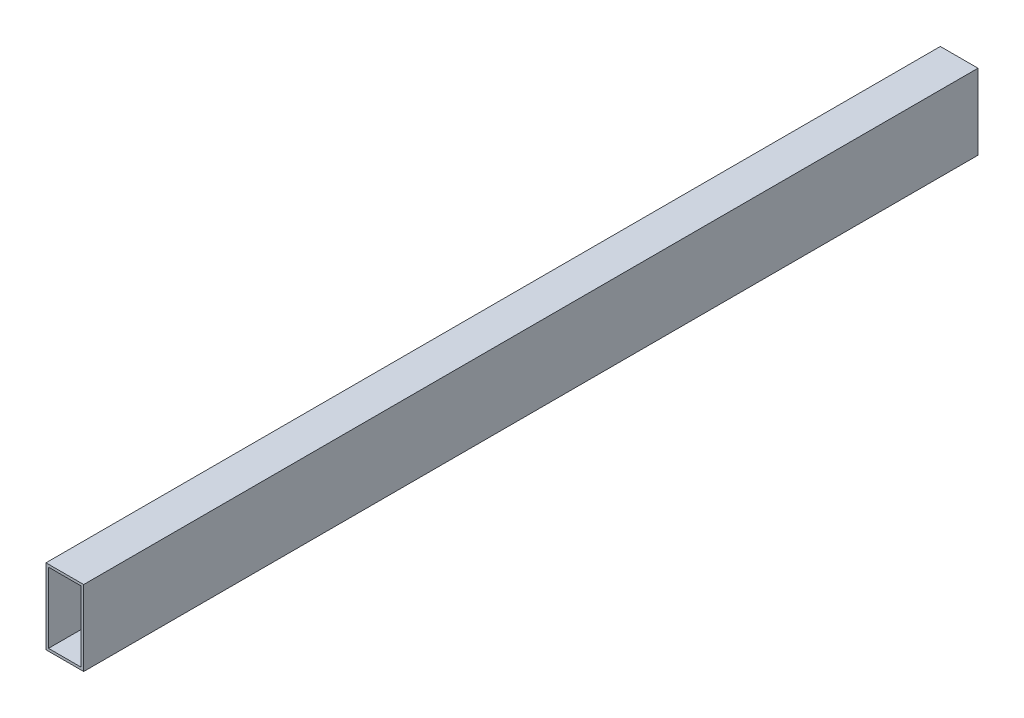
ISO-10303-21;
HEADER;
FILE_DESCRIPTION(('STEP AP214'),'2;1');
FILE_NAME('part.step','',(''),(''),'','','');
FILE_SCHEMA(('AUTOMOTIVE_DESIGN { 1 0 10303 214 1 1 1 1 }'));
ENDSEC;
DATA;
#1=APPLICATION_CONTEXT('core data for automotive mechanical design processes');
#2=APPLICATION_PROTOCOL_DEFINITION('international standard','automotive_design',2000,#1);
#3=PRODUCT_CONTEXT('',#1,'mechanical');
#4=PRODUCT('Part','Part','',(#3));
#5=PRODUCT_RELATED_PRODUCT_CATEGORY('part','',(#4));
#6=PRODUCT_DEFINITION_FORMATION('','',#4);
#7=PRODUCT_DEFINITION_CONTEXT('part definition',#1,'design');
#8=PRODUCT_DEFINITION('design','',#6,#7);
#9=PRODUCT_DEFINITION_SHAPE('','',#8);
#10=(LENGTH_UNIT() NAMED_UNIT(*) SI_UNIT(.MILLI.,.METRE.));
#11=(NAMED_UNIT(*) PLANE_ANGLE_UNIT() SI_UNIT($,.RADIAN.));
#12=(NAMED_UNIT(*) SI_UNIT($,.STERADIAN.) SOLID_ANGLE_UNIT());
#13=UNCERTAINTY_MEASURE_WITH_UNIT(LENGTH_MEASURE(1.E-05),#10,'distance_accuracy_value','');
#14=(GEOMETRIC_REPRESENTATION_CONTEXT(3) GLOBAL_UNCERTAINTY_ASSIGNED_CONTEXT((#13)) GLOBAL_UNIT_ASSIGNED_CONTEXT((#10,
#11,#12)) REPRESENTATION_CONTEXT('',''));
#15=CARTESIAN_POINT('',(0.,0.,0.));
#16=DIRECTION('',(0.,0.,1.));
#17=DIRECTION('',(1.,0.,0.));
#18=AXIS2_PLACEMENT_3D('',#15,#16,#17);
#19=CARTESIAN_POINT('',(0.,0.,1780.));
#20=DIRECTION('',(0.,0.,1.));
#21=DIRECTION('',(1.,0.,0.));
#22=AXIS2_PLACEMENT_3D('',#19,#20,#21);
#23=PLANE('',#22);
#24=DIRECTION('',(0.,-1.,0.));
#25=VECTOR('',#24,1.);
#26=CARTESIAN_POINT('',(-32.5,70.,1780.));
#27=LINE('',#26,#25);
#28=CARTESIAN_POINT('',(-32.5,70.,1780.));
#29=VERTEX_POINT('',#28);
#30=CARTESIAN_POINT('',(-32.5,-70.,1780.));
#31=VERTEX_POINT('',#30);
#32=EDGE_CURVE('E25',#29,#31,#27,.T.);
#33=ORIENTED_EDGE('',*,*,#32,.F.);
#34=DIRECTION('',(-1.,0.,0.));
#35=VECTOR('',#34,1.);
#36=CARTESIAN_POINT('',(32.5,70.,1780.));
#37=LINE('',#36,#35);
#38=CARTESIAN_POINT('',(32.5,70.,1780.));
#39=VERTEX_POINT('',#38);
#40=EDGE_CURVE('E63',#39,#29,#37,.T.);
#41=ORIENTED_EDGE('',*,*,#40,.F.);
#42=DIRECTION('',(0.,1.,0.));
#43=VECTOR('',#42,1.);
#44=CARTESIAN_POINT('',(32.5,-70.,1780.));
#45=LINE('',#44,#43);
#46=CARTESIAN_POINT('',(32.5,-70.,1780.));
#47=VERTEX_POINT('',#46);
#48=EDGE_CURVE('E168',#47,#39,#45,.T.);
#49=ORIENTED_EDGE('',*,*,#48,.F.);
#50=DIRECTION('',(1.,0.,0.));
#51=VECTOR('',#50,1.);
#52=CARTESIAN_POINT('',(-32.5,-70.,1780.));
#53=LINE('',#52,#51);
#54=EDGE_CURVE('E140',#31,#47,#53,.T.);
#55=ORIENTED_EDGE('',*,*,#54,.F.);
#56=EDGE_LOOP('',(#33,#41,#49,#55));
#57=FACE_BOUND('',#56,.T.);
#58=DIRECTION('',(1.,0.,0.));
#59=VECTOR('',#58,1.);
#60=CARTESIAN_POINT('',(-37.5,-75.,1780.));
#61=LINE('',#60,#59);
#62=CARTESIAN_POINT('',(-37.5,-75.,1780.));
#63=VERTEX_POINT('',#62);
#64=CARTESIAN_POINT('',(37.5,-75.,1780.));
#65=VERTEX_POINT('',#64);
#66=EDGE_CURVE('E130',#63,#65,#61,.T.);
#67=ORIENTED_EDGE('',*,*,#66,.T.);
#68=DIRECTION('',(0.,1.,0.));
#69=VECTOR('',#68,1.);
#70=CARTESIAN_POINT('',(37.5,-75.,1780.));
#71=LINE('',#70,#69);
#72=CARTESIAN_POINT('',(37.5,75.,1780.));
#73=VERTEX_POINT('',#72);
#74=EDGE_CURVE('E125',#65,#73,#71,.T.);
#75=ORIENTED_EDGE('',*,*,#74,.T.);
#76=DIRECTION('',(-1.,0.,0.));
#77=VECTOR('',#76,1.);
#78=CARTESIAN_POINT('',(37.5,75.,1780.));
#79=LINE('',#78,#77);
#80=CARTESIAN_POINT('',(-37.5,75.,1780.));
#81=VERTEX_POINT('',#80);
#82=EDGE_CURVE('E152',#73,#81,#79,.T.);
#83=ORIENTED_EDGE('',*,*,#82,.T.);
#84=DIRECTION('',(0.,-1.,0.));
#85=VECTOR('',#84,1.);
#86=CARTESIAN_POINT('',(-37.5,75.,1780.));
#87=LINE('',#86,#85);
#88=EDGE_CURVE('E151',#81,#63,#87,.T.);
#89=ORIENTED_EDGE('',*,*,#88,.T.);
#90=EDGE_LOOP('',(#67,#75,#83,#89));
#91=FACE_BOUND('',#90,.T.);
#92=ADVANCED_FACE('F16',(#57,#91),#23,.T.);
#93=CARTESIAN_POINT('',(0.,0.,0.));
#94=DIRECTION('',(0.,0.,1.));
#95=DIRECTION('',(1.,0.,0.));
#96=AXIS2_PLACEMENT_3D('',#93,#94,#95);
#97=PLANE('',#96);
#98=DIRECTION('',(1.,0.,0.));
#99=VECTOR('',#98,1.);
#100=CARTESIAN_POINT('',(-32.5,-70.,0.));
#101=LINE('',#100,#99);
#102=CARTESIAN_POINT('',(-32.5,-70.,0.));
#103=VERTEX_POINT('',#102);
#104=CARTESIAN_POINT('',(32.5,-70.,0.));
#105=VERTEX_POINT('',#104);
#106=EDGE_CURVE('E165',#103,#105,#101,.T.);
#107=ORIENTED_EDGE('',*,*,#106,.T.);
#108=DIRECTION('',(0.,1.,0.));
#109=VECTOR('',#108,1.);
#110=CARTESIAN_POINT('',(32.5,-70.,0.));
#111=LINE('',#110,#109);
#112=CARTESIAN_POINT('',(32.5,70.,0.));
#113=VERTEX_POINT('',#112);
#114=EDGE_CURVE('E73',#105,#113,#111,.T.);
#115=ORIENTED_EDGE('',*,*,#114,.T.);
#116=DIRECTION('',(-1.,0.,0.));
#117=VECTOR('',#116,1.);
#118=CARTESIAN_POINT('',(32.5,70.,0.));
#119=LINE('',#118,#117);
#120=CARTESIAN_POINT('',(-32.5,70.,0.));
#121=VERTEX_POINT('',#120);
#122=EDGE_CURVE('E176',#113,#121,#119,.T.);
#123=ORIENTED_EDGE('',*,*,#122,.T.);
#124=DIRECTION('',(0.,-1.,0.));
#125=VECTOR('',#124,1.);
#126=CARTESIAN_POINT('',(-32.5,70.,0.));
#127=LINE('',#126,#125);
#128=EDGE_CURVE('E10',#121,#103,#127,.T.);
#129=ORIENTED_EDGE('',*,*,#128,.T.);
#130=EDGE_LOOP('',(#107,#115,#123,#129));
#131=FACE_BOUND('',#130,.T.);
#132=DIRECTION('',(0.,-1.,0.));
#133=VECTOR('',#132,1.);
#134=CARTESIAN_POINT('',(-37.5,75.,0.));
#135=LINE('',#134,#133);
#136=CARTESIAN_POINT('',(-37.5,75.,0.));
#137=VERTEX_POINT('',#136);
#138=CARTESIAN_POINT('',(-37.5,-75.,0.));
#139=VERTEX_POINT('',#138);
#140=EDGE_CURVE('E148',#137,#139,#135,.T.);
#141=ORIENTED_EDGE('',*,*,#140,.F.);
#142=DIRECTION('',(-1.,0.,0.));
#143=VECTOR('',#142,1.);
#144=CARTESIAN_POINT('',(37.5,75.,0.));
#145=LINE('',#144,#143);
#146=CARTESIAN_POINT('',(37.5,75.,0.));
#147=VERTEX_POINT('',#146);
#148=EDGE_CURVE('E113',#147,#137,#145,.T.);
#149=ORIENTED_EDGE('',*,*,#148,.F.);
#150=DIRECTION('',(0.,1.,0.));
#151=VECTOR('',#150,1.);
#152=CARTESIAN_POINT('',(37.5,-75.,0.));
#153=LINE('',#152,#151);
#154=CARTESIAN_POINT('',(37.5,-75.,0.));
#155=VERTEX_POINT('',#154);
#156=EDGE_CURVE('E107',#155,#147,#153,.T.);
#157=ORIENTED_EDGE('',*,*,#156,.F.);
#158=DIRECTION('',(1.,0.,0.));
#159=VECTOR('',#158,1.);
#160=CARTESIAN_POINT('',(-37.5,-75.,0.));
#161=LINE('',#160,#159);
#162=EDGE_CURVE('E111',#139,#155,#161,.T.);
#163=ORIENTED_EDGE('',*,*,#162,.F.);
#164=EDGE_LOOP('',(#141,#149,#157,#163));
#165=FACE_BOUND('',#164,.T.);
#166=ADVANCED_FACE('F109',(#131,#165),#97,.F.);
#167=CARTESIAN_POINT('',(-32.5,70.,0.));
#168=DIRECTION('',(1.,0.,0.));
#169=DIRECTION('',(0.,1.,0.));
#170=AXIS2_PLACEMENT_3D('',#167,#168,#169);
#171=PLANE('',#170);
#172=DIRECTION('',(0.,0.,1.));
#173=VECTOR('',#172,1.);
#174=CARTESIAN_POINT('',(-32.5,70.,0.));
#175=LINE('',#174,#173);
#176=EDGE_CURVE('E179',#121,#29,#175,.T.);
#177=ORIENTED_EDGE('',*,*,#176,.T.);
#178=ORIENTED_EDGE('',*,*,#32,.T.);
#179=DIRECTION('',(0.,0.,1.));
#180=VECTOR('',#179,1.);
#181=CARTESIAN_POINT('',(-32.5,-70.,0.));
#182=LINE('',#181,#180);
#183=EDGE_CURVE('E172',#103,#31,#182,.T.);
#184=ORIENTED_EDGE('',*,*,#183,.F.);
#185=ORIENTED_EDGE('',*,*,#128,.F.);
#186=EDGE_LOOP('',(#177,#178,#184,#185));
#187=FACE_BOUND('',#186,.T.);
#188=ADVANCED_FACE('F194',(#187),#171,.T.);
#189=CARTESIAN_POINT('',(32.5,70.,0.));
#190=DIRECTION('',(0.,-1.,0.));
#191=DIRECTION('',(0.,0.,-1.));
#192=AXIS2_PLACEMENT_3D('',#189,#190,#191);
#193=PLANE('',#192);
#194=DIRECTION('',(0.,0.,1.));
#195=VECTOR('',#194,1.);
#196=CARTESIAN_POINT('',(32.5,70.,0.));
#197=LINE('',#196,#195);
#198=EDGE_CURVE('E183',#113,#39,#197,.T.);
#199=ORIENTED_EDGE('',*,*,#198,.T.);
#200=ORIENTED_EDGE('',*,*,#40,.T.);
#201=ORIENTED_EDGE('',*,*,#176,.F.);
#202=ORIENTED_EDGE('',*,*,#122,.F.);
#203=EDGE_LOOP('',(#199,#200,#201,#202));
#204=FACE_BOUND('',#203,.T.);
#205=ADVANCED_FACE('F197',(#204),#193,.T.);
#206=CARTESIAN_POINT('',(32.5,-70.,0.));
#207=DIRECTION('',(-1.,0.,0.));
#208=DIRECTION('',(0.,0.,1.));
#209=AXIS2_PLACEMENT_3D('',#206,#207,#208);
#210=PLANE('',#209);
#211=DIRECTION('',(0.,0.,1.));
#212=VECTOR('',#211,1.);
#213=CARTESIAN_POINT('',(32.5,-70.,0.));
#214=LINE('',#213,#212);
#215=EDGE_CURVE('E169',#105,#47,#214,.T.);
#216=ORIENTED_EDGE('',*,*,#215,.T.);
#217=ORIENTED_EDGE('',*,*,#48,.T.);
#218=ORIENTED_EDGE('',*,*,#198,.F.);
#219=ORIENTED_EDGE('',*,*,#114,.F.);
#220=EDGE_LOOP('',(#216,#217,#218,#219));
#221=FACE_BOUND('',#220,.T.);
#222=ADVANCED_FACE('F198',(#221),#210,.T.);
#223=CARTESIAN_POINT('',(-32.5,-70.,0.));
#224=DIRECTION('',(0.,1.,0.));
#225=DIRECTION('',(1.,0.,0.));
#226=AXIS2_PLACEMENT_3D('',#223,#224,#225);
#227=PLANE('',#226);
#228=ORIENTED_EDGE('',*,*,#183,.T.);
#229=ORIENTED_EDGE('',*,*,#54,.T.);
#230=ORIENTED_EDGE('',*,*,#215,.F.);
#231=ORIENTED_EDGE('',*,*,#106,.F.);
#232=EDGE_LOOP('',(#228,#229,#230,#231));
#233=FACE_BOUND('',#232,.T.);
#234=ADVANCED_FACE('F204',(#233),#227,.T.);
#235=CARTESIAN_POINT('',(-37.5,75.,0.));
#236=DIRECTION('',(1.,0.,0.));
#237=DIRECTION('',(0.,1.,0.));
#238=AXIS2_PLACEMENT_3D('',#235,#236,#237);
#239=PLANE('',#238);
#240=ORIENTED_EDGE('',*,*,#140,.T.);
#241=DIRECTION('',(0.,0.,1.));
#242=VECTOR('',#241,1.);
#243=CARTESIAN_POINT('',(-37.5,-75.,0.));
#244=LINE('',#243,#242);
#245=EDGE_CURVE('E119',#139,#63,#244,.T.);
#246=ORIENTED_EDGE('',*,*,#245,.T.);
#247=ORIENTED_EDGE('',*,*,#88,.F.);
#248=DIRECTION('',(0.,0.,1.));
#249=VECTOR('',#248,1.);
#250=CARTESIAN_POINT('',(-37.5,75.,0.));
#251=LINE('',#250,#249);
#252=EDGE_CURVE('E145',#137,#81,#251,.T.);
#253=ORIENTED_EDGE('',*,*,#252,.F.);
#254=EDGE_LOOP('',(#240,#246,#247,#253));
#255=FACE_BOUND('',#254,.T.);
#256=ADVANCED_FACE('F220',(#255),#239,.F.);
#257=CARTESIAN_POINT('',(37.5,75.,0.));
#258=DIRECTION('',(0.,-1.,0.));
#259=DIRECTION('',(0.,0.,-1.));
#260=AXIS2_PLACEMENT_3D('',#257,#258,#259);
#261=PLANE('',#260);
#262=ORIENTED_EDGE('',*,*,#148,.T.);
#263=ORIENTED_EDGE('',*,*,#252,.T.);
#264=ORIENTED_EDGE('',*,*,#82,.F.);
#265=DIRECTION('',(0.,0.,1.));
#266=VECTOR('',#265,1.);
#267=CARTESIAN_POINT('',(37.5,75.,0.));
#268=LINE('',#267,#266);
#269=EDGE_CURVE('E118',#147,#73,#268,.T.);
#270=ORIENTED_EDGE('',*,*,#269,.F.);
#271=EDGE_LOOP('',(#262,#263,#264,#270));
#272=FACE_BOUND('',#271,.T.);
#273=ADVANCED_FACE('F223',(#272),#261,.F.);
#274=CARTESIAN_POINT('',(37.5,-75.,0.));
#275=DIRECTION('',(-1.,0.,0.));
#276=DIRECTION('',(0.,0.,1.));
#277=AXIS2_PLACEMENT_3D('',#274,#275,#276);
#278=PLANE('',#277);
#279=ORIENTED_EDGE('',*,*,#156,.T.);
#280=ORIENTED_EDGE('',*,*,#269,.T.);
#281=ORIENTED_EDGE('',*,*,#74,.F.);
#282=DIRECTION('',(0.,0.,1.));
#283=VECTOR('',#282,1.);
#284=CARTESIAN_POINT('',(37.5,-75.,0.));
#285=LINE('',#284,#283);
#286=EDGE_CURVE('E122',#155,#65,#285,.T.);
#287=ORIENTED_EDGE('',*,*,#286,.F.);
#288=EDGE_LOOP('',(#279,#280,#281,#287));
#289=FACE_BOUND('',#288,.T.);
#290=ADVANCED_FACE('F123',(#289),#278,.F.);
#291=CARTESIAN_POINT('',(-37.5,-75.,0.));
#292=DIRECTION('',(0.,1.,0.));
#293=DIRECTION('',(1.,0.,0.));
#294=AXIS2_PLACEMENT_3D('',#291,#292,#293);
#295=PLANE('',#294);
#296=ORIENTED_EDGE('',*,*,#162,.T.);
#297=ORIENTED_EDGE('',*,*,#286,.T.);
#298=ORIENTED_EDGE('',*,*,#66,.F.);
#299=ORIENTED_EDGE('',*,*,#245,.F.);
#300=EDGE_LOOP('',(#296,#297,#298,#299));
#301=FACE_BOUND('',#300,.T.);
#302=ADVANCED_FACE('F133',(#301),#295,.F.);
#303=CLOSED_SHELL('',(#92,#166,#188,#205,#222,#234,#256,#273,#290,#302));
#304=MANIFOLD_SOLID_BREP('B1',#303);
#305=ADVANCED_BREP_SHAPE_REPRESENTATION('',(#18,#304),#14);
#306=SHAPE_DEFINITION_REPRESENTATION(#9,#305);
ENDSEC;
END-ISO-10303-21;
